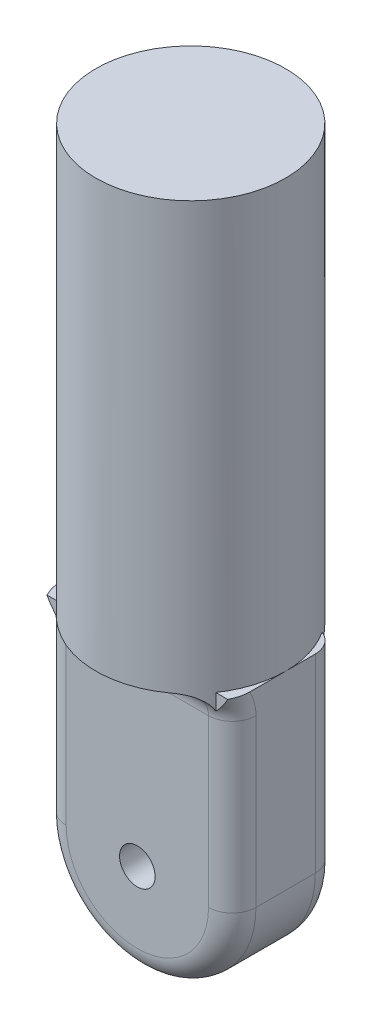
ISO-10303-21;
HEADER;
FILE_DESCRIPTION(('STEP AP214'),'2;1');
FILE_NAME('part.step','',(''),(''),'','','');
FILE_SCHEMA(('AUTOMOTIVE_DESIGN { 1 0 10303 214 1 1 1 1 }'));
ENDSEC;
DATA;
#1=APPLICATION_CONTEXT('core data for automotive mechanical design processes');
#2=APPLICATION_PROTOCOL_DEFINITION('international standard','automotive_design',2000,#1);
#3=PRODUCT_CONTEXT('',#1,'mechanical');
#4=PRODUCT('Part','Part','',(#3));
#5=PRODUCT_RELATED_PRODUCT_CATEGORY('part','',(#4));
#6=PRODUCT_DEFINITION_FORMATION('','',#4);
#7=PRODUCT_DEFINITION_CONTEXT('part definition',#1,'design');
#8=PRODUCT_DEFINITION('design','',#6,#7);
#9=PRODUCT_DEFINITION_SHAPE('','',#8);
#10=(LENGTH_UNIT() NAMED_UNIT(*) SI_UNIT(.MILLI.,.METRE.));
#11=(NAMED_UNIT(*) PLANE_ANGLE_UNIT() SI_UNIT($,.RADIAN.));
#12=(NAMED_UNIT(*) SI_UNIT($,.STERADIAN.) SOLID_ANGLE_UNIT());
#13=UNCERTAINTY_MEASURE_WITH_UNIT(LENGTH_MEASURE(1.E-05),#10,'distance_accuracy_value','');
#14=(GEOMETRIC_REPRESENTATION_CONTEXT(3) GLOBAL_UNCERTAINTY_ASSIGNED_CONTEXT((#13)) GLOBAL_UNIT_ASSIGNED_CONTEXT((#10,
#11,#12)) REPRESENTATION_CONTEXT('',''));
#15=CARTESIAN_POINT('',(0.,0.,0.));
#16=DIRECTION('',(0.,0.,1.));
#17=DIRECTION('',(1.,0.,0.));
#18=AXIS2_PLACEMENT_3D('',#15,#16,#17);
#19=CARTESIAN_POINT('',(0.,0.,14.2875));
#20=DIRECTION('',(0.,0.,1.));
#21=DIRECTION('',(1.,0.,0.));
#22=AXIS2_PLACEMENT_3D('',#19,#20,#21);
#23=PLANE('',#22);
#24=DIRECTION('',(0.,-1.,0.));
#25=VECTOR('',#24,1.);
#26=CARTESIAN_POINT('',(21.0006510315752,50.8,14.2875));
#27=LINE('',#26,#25);
#28=CARTESIAN_POINT('',(21.0006510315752,50.8,14.2875));
#29=VERTEX_POINT('',#28);
#30=CARTESIAN_POINT('',(21.0006510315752,46.4483935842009,14.2875));
#31=VERTEX_POINT('',#30);
#32=EDGE_CURVE('E209',#29,#31,#27,.T.);
#33=ORIENTED_EDGE('',*,*,#32,.T.);
#34=CARTESIAN_POINT('',(21.0006510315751,46.4483935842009,14.2875));
#35=CARTESIAN_POINT('',(21.366303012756,46.841466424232,14.2875));
#36=CARTESIAN_POINT('',(21.7243326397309,47.2430550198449,14.2875));
#37=CARTESIAN_POINT('',(22.4102900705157,48.0655256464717,14.2875));
#38=CARTESIAN_POINT('',(22.7384365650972,48.4862267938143,14.2875));
#39=CARTESIAN_POINT('',(23.2031749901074,49.1402212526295,14.2875));
#40=CARTESIAN_POINT('',(23.354182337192,49.3631991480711,14.2875));
#41=CARTESIAN_POINT('',(23.6446018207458,49.8165414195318,14.2875));
#42=CARTESIAN_POINT('',(23.7840163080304,50.0469042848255,14.2875));
#43=CARTESIAN_POINT('',(24.0505781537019,50.5171441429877,14.2875));
#44=CARTESIAN_POINT('',(24.1776169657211,50.7570831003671,14.2875));
#45=CARTESIAN_POINT('',(24.4163150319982,51.2447470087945,14.2875));
#46=CARTESIAN_POINT('',(24.5279600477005,51.4924789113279,14.2875));
#47=CARTESIAN_POINT('',(24.6308788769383,51.743909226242,14.2875));
#48=B_SPLINE_CURVE_WITH_KNOTS('',3,(#34,#35,#36,#37,#38,#39,#40,#41,#42,#43,#44,#45,#46,#47),
.UNSPECIFIED.,.F.,.F.,(4,2,2,2,2,2,4),(0.,1.61211219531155,3.21127521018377,4.01885255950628,
4.82626574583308,5.64022095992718,6.45492406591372),.UNSPECIFIED.);
#49=CARTESIAN_POINT('',(24.1964556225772,50.8,14.2875));
#50=VERTEX_POINT('',#49);
#51=EDGE_CURVE('E414',#31,#50,#48,.T.);
#52=ORIENTED_EDGE('',*,*,#51,.T.);
#53=DIRECTION('',(-1.,0.,0.));
#54=VECTOR('',#53,1.);
#55=CARTESIAN_POINT('',(-25.4,50.8,14.2875));
#56=LINE('',#55,#54);
#57=EDGE_CURVE('E187',#50,#29,#56,.T.);
#58=ORIENTED_EDGE('',*,*,#57,.T.);
#59=EDGE_LOOP('',(#33,#52,#58));
#60=FACE_BOUND('',#59,.T.);
#61=ADVANCED_FACE('F36',(#60),#23,.T.);
#62=CARTESIAN_POINT('',(0.,0.,14.2875));
#63=DIRECTION('',(0.,0.,1.));
#64=DIRECTION('',(1.,0.,0.));
#65=AXIS2_PLACEMENT_3D('',#62,#63,#64);
#66=CIRCLE('',#65,4.7625);
#67=CARTESIAN_POINT('',(4.7625,0.,14.2875));
#68=VERTEX_POINT('',#67);
#69=EDGE_CURVE('E477',#68,#68,#66,.T.);
#70=ORIENTED_EDGE('',*,*,#69,.F.);
#71=EDGE_LOOP('',(#70));
#72=FACE_BOUND('',#71,.T.);
#73=CARTESIAN_POINT('',(0.,0.,14.2875));
#74=DIRECTION('',(0.,0.,1.));
#75=DIRECTION('',(1.,0.,0.));
#76=AXIS2_PLACEMENT_3D('',#73,#74,#75);
#77=CIRCLE('',#76,19.05);
#78=CARTESIAN_POINT('',(-19.05,0.,14.2875));
#79=VERTEX_POINT('',#78);
#80=CARTESIAN_POINT('',(19.05,0.,14.2875));
#81=VERTEX_POINT('',#80);
#82=EDGE_CURVE('E409',#79,#81,#77,.T.);
#83=ORIENTED_EDGE('',*,*,#82,.T.);
#84=DIRECTION('',(0.,1.,0.));
#85=VECTOR('',#84,1.);
#86=CARTESIAN_POINT('',(19.05,50.8,14.2875));
#87=LINE('',#86,#85);
#88=CARTESIAN_POINT('',(19.05,44.45,14.2875));
#89=VERTEX_POINT('',#88);
#90=EDGE_CURVE('E411',#81,#89,#87,.T.);
#91=ORIENTED_EDGE('',*,*,#90,.T.);
#92=DIRECTION('',(-1.,0.,0.));
#93=VECTOR('',#92,1.);
#94=CARTESIAN_POINT('',(0.,44.45,14.2875));
#95=LINE('',#94,#93);
#96=CARTESIAN_POINT('',(-19.05,44.45,14.2875));
#97=VERTEX_POINT('',#96);
#98=EDGE_CURVE('E177',#89,#97,#95,.T.);
#99=ORIENTED_EDGE('',*,*,#98,.T.);
#100=DIRECTION('',(0.,-1.,0.));
#101=VECTOR('',#100,1.);
#102=CARTESIAN_POINT('',(-19.05,0.,14.2875));
#103=LINE('',#102,#101);
#104=EDGE_CURVE('E407',#97,#79,#103,.T.);
#105=ORIENTED_EDGE('',*,*,#104,.T.);
#106=EDGE_LOOP('',(#83,#91,#99,#105));
#107=FACE_BOUND('',#106,.T.);
#108=ADVANCED_FACE('F348',(#72,#107),#23,.T.);
#109=CARTESIAN_POINT('',(-25.4,50.8,14.2875));
#110=DIRECTION('',(0.,-1.,0.));
#111=DIRECTION('',(0.,0.,-1.));
#112=AXIS2_PLACEMENT_3D('',#109,#110,#111);
#113=PLANE('',#112);
#114=ORIENTED_EDGE('',*,*,#57,.F.);
#115=CARTESIAN_POINT('',(24.1964556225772,50.8,14.2875));
#116=CARTESIAN_POINT('',(24.3199061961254,50.8,14.0460022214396));
#117=CARTESIAN_POINT('',(24.4359016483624,50.8,13.8005579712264));
#118=CARTESIAN_POINT('',(24.6511155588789,50.8,13.3021019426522));
#119=CARTESIAN_POINT('',(24.7503143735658,50.8,13.0490817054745));
#120=CARTESIAN_POINT('',(24.9274933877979,50.8,12.5428736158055));
#121=CARTESIAN_POINT('',(25.0059484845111,50.8,12.2898532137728));
#122=CARTESIAN_POINT('',(25.1429953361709,50.8,11.7785502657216));
#123=CARTESIAN_POINT('',(25.2015948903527,50.8,11.5202698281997));
#124=CARTESIAN_POINT('',(25.2912364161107,50.8,11.0320996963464));
#125=CARTESIAN_POINT('',(25.324799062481,50.8,10.802673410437));
#126=CARTESIAN_POINT('',(25.3742303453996,50.8,10.3419394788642));
#127=CARTESIAN_POINT('',(25.3901022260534,50.8,10.1106321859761));
#128=CARTESIAN_POINT('',(25.4032726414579,50.8,9.6422676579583));
#129=CARTESIAN_POINT('',(25.4001473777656,50.8,9.40519763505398));
#130=CARTESIAN_POINT('',(25.3734212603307,50.8,8.93200232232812));
#131=CARTESIAN_POINT('',(25.3498009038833,50.8,8.69587814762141));
#132=CARTESIAN_POINT('',(25.3154802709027,50.8,8.4612228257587));
#133=B_SPLINE_CURVE_WITH_KNOTS('',3,(#115,#116,#117,#118,#119,#120,#121,#122,#123,#124,#125,
#126,#127,#128,#129,#130,#131,#132),.UNSPECIFIED.,.F.,.F.,(4,2,2,2,2,2,2,2,4),(0.,
0.813717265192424,1.62837969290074,2.42235254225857,3.21601315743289,3.91098147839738,
4.60582233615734,5.31622012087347,6.02729464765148),.UNSPECIFIED.);
#134=CARTESIAN_POINT('',(25.4,50.8,9.63897737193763));
#135=VERTEX_POINT('',#134);
#136=EDGE_CURVE('E378',#50,#135,#133,.T.);
#137=ORIENTED_EDGE('',*,*,#136,.T.);
#138=DIRECTION('',(0.,0.,-1.));
#139=VECTOR('',#138,1.);
#140=CARTESIAN_POINT('',(25.4,50.8,14.2875));
#141=LINE('',#140,#139);
#142=CARTESIAN_POINT('',(25.4,50.8,0.));
#143=VERTEX_POINT('',#142);
#144=EDGE_CURVE('E202',#135,#143,#141,.T.);
#145=ORIENTED_EDGE('',*,*,#144,.T.);
#146=CARTESIAN_POINT('',(0.,50.8,0.));
#147=DIRECTION('',(0.,1.,0.));
#148=DIRECTION('',(0.,0.,1.));
#149=AXIS2_PLACEMENT_3D('',#146,#147,#148);
#150=CIRCLE('',#149,25.4);
#151=EDGE_CURVE('E197',#29,#143,#150,.T.);
#152=ORIENTED_EDGE('',*,*,#151,.F.);
#153=EDGE_LOOP('',(#114,#137,#145,#152));
#154=FACE_BOUND('',#153,.T.);
#155=ADVANCED_FACE('F353',(#154),#113,.F.);
#156=CARTESIAN_POINT('',(25.4,50.8,-7.9375));
#157=VERTEX_POINT('',#156);
#158=EDGE_CURVE('E481',#143,#157,#141,.T.);
#159=ORIENTED_EDGE('',*,*,#158,.T.);
#160=CARTESIAN_POINT('',(19.05,50.8,-7.9375));
#161=DIRECTION('',(0.,-1.,0.));
#162=DIRECTION('',(0.,0.,-1.));
#163=AXIS2_PLACEMENT_3D('',#160,#161,#162);
#164=CIRCLE('',#163,6.35);
#165=CARTESIAN_POINT('',(21.2670184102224,50.8,-13.8879058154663));
#166=VERTEX_POINT('',#165);
#167=EDGE_CURVE('E234',#157,#166,#164,.F.);
#168=ORIENTED_EDGE('',*,*,#167,.T.);
#169=EDGE_CURVE('E198',#143,#166,#150,.T.);
#170=ORIENTED_EDGE('',*,*,#169,.F.);
#171=EDGE_LOOP('',(#159,#168,#170));
#172=FACE_BOUND('',#171,.T.);
#173=ADVANCED_FACE('F485',(#172),#113,.F.);
#174=CARTESIAN_POINT('',(-21.2670184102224,50.8,-13.8879058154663));
#175=VERTEX_POINT('',#174);
#176=CARTESIAN_POINT('',(-25.4,50.8,0.));
#177=VERTEX_POINT('',#176);
#178=EDGE_CURVE('E193',#175,#177,#150,.T.);
#179=ORIENTED_EDGE('',*,*,#178,.F.);
#180=CARTESIAN_POINT('',(-19.05,50.8,-7.9375));
#181=DIRECTION('',(0.,-1.,0.));
#182=DIRECTION('',(0.,0.,-1.));
#183=AXIS2_PLACEMENT_3D('',#180,#181,#182);
#184=CIRCLE('',#183,6.35);
#185=CARTESIAN_POINT('',(-25.4,50.8,-7.9375));
#186=VERTEX_POINT('',#185);
#187=EDGE_CURVE('E248',#175,#186,#184,.F.);
#188=ORIENTED_EDGE('',*,*,#187,.T.);
#189=DIRECTION('',(0.,0.,-1.));
#190=VECTOR('',#189,1.);
#191=CARTESIAN_POINT('',(-25.4,50.8,14.2875));
#192=LINE('',#191,#190);
#193=EDGE_CURVE('E474',#177,#186,#192,.T.);
#194=ORIENTED_EDGE('',*,*,#193,.F.);
#195=EDGE_LOOP('',(#179,#188,#194));
#196=FACE_BOUND('',#195,.T.);
#197=ADVANCED_FACE('F372',(#196),#113,.F.);
#198=CARTESIAN_POINT('',(0.,0.,14.2875));
#199=DIRECTION('',(0.,0.,-1.));
#200=DIRECTION('',(-1.,0.,0.));
#201=AXIS2_PLACEMENT_3D('',#198,#199,#200);
#202=CYLINDRICAL_SURFACE('',#201,25.4);
#203=DIRECTION('',(0.,0.,-1.));
#204=VECTOR('',#203,1.);
#205=CARTESIAN_POINT('',(-25.4,0.,14.2875));
#206=LINE('',#205,#204);
#207=CARTESIAN_POINT('',(-25.4,0.,7.9375));
#208=VERTEX_POINT('',#207);
#209=CARTESIAN_POINT('',(-25.4,0.,-7.9375));
#210=VERTEX_POINT('',#209);
#211=EDGE_CURVE('E472',#208,#210,#206,.T.);
#212=ORIENTED_EDGE('',*,*,#211,.T.);
#213=CARTESIAN_POINT('',(0.,0.,-7.9375));
#214=DIRECTION('',(0.,0.,1.));
#215=DIRECTION('',(1.,0.,0.));
#216=AXIS2_PLACEMENT_3D('',#213,#214,#215);
#217=CIRCLE('',#216,25.4);
#218=CARTESIAN_POINT('',(25.4,0.,-7.9375));
#219=VERTEX_POINT('',#218);
#220=EDGE_CURVE('E244',#210,#219,#217,.T.);
#221=ORIENTED_EDGE('',*,*,#220,.T.);
#222=DIRECTION('',(0.,0.,-1.));
#223=VECTOR('',#222,1.);
#224=CARTESIAN_POINT('',(25.4,0.,14.2875));
#225=LINE('',#224,#223);
#226=CARTESIAN_POINT('',(25.4,0.,7.9375));
#227=VERTEX_POINT('',#226);
#228=EDGE_CURVE('E195',#227,#219,#225,.T.);
#229=ORIENTED_EDGE('',*,*,#228,.F.);
#230=CARTESIAN_POINT('',(0.,0.,7.9375));
#231=DIRECTION('',(0.,0.,1.));
#232=DIRECTION('',(1.,0.,0.));
#233=AXIS2_PLACEMENT_3D('',#230,#231,#232);
#234=CIRCLE('',#233,25.4);
#235=EDGE_CURVE('E438',#227,#208,#234,.F.);
#236=ORIENTED_EDGE('',*,*,#235,.T.);
#237=EDGE_LOOP('',(#212,#221,#229,#236));
#238=FACE_BOUND('',#237,.T.);
#239=ADVANCED_FACE('F507',(#238),#202,.T.);
#240=CARTESIAN_POINT('',(25.4,0.,14.2875));
#241=DIRECTION('',(-1.,0.,0.));
#242=DIRECTION('',(0.,0.,1.));
#243=AXIS2_PLACEMENT_3D('',#240,#241,#242);
#244=PLANE('',#243);
#245=ORIENTED_EDGE('',*,*,#228,.T.);
#246=DIRECTION('',(0.,1.,0.));
#247=VECTOR('',#246,1.);
#248=CARTESIAN_POINT('',(25.4,0.,-7.9375));
#249=LINE('',#248,#247);
#250=EDGE_CURVE('E231',#219,#157,#249,.T.);
#251=ORIENTED_EDGE('',*,*,#250,.T.);
#252=ORIENTED_EDGE('',*,*,#158,.F.);
#253=ORIENTED_EDGE('',*,*,#144,.F.);
#254=CARTESIAN_POINT('',(25.4,44.45,20.6375));
#255=DIRECTION('',(-1.,0.,0.));
#256=DIRECTION('',(0.,0.,1.));
#257=AXIS2_PLACEMENT_3D('',#254,#255,#256);
#258=CIRCLE('',#257,12.7);
#259=CARTESIAN_POINT('',(25.4,44.45,7.9375));
#260=VERTEX_POINT('',#259);
#261=EDGE_CURVE('E443',#135,#260,#258,.T.);
#262=ORIENTED_EDGE('',*,*,#261,.T.);
#263=DIRECTION('',(0.,1.,0.));
#264=VECTOR('',#263,1.);
#265=CARTESIAN_POINT('',(25.4,0.,7.9375));
#266=LINE('',#265,#264);
#267=EDGE_CURVE('E446',#260,#227,#266,.F.);
#268=ORIENTED_EDGE('',*,*,#267,.T.);
#269=EDGE_LOOP('',(#245,#251,#252,#253,#262,#268));
#270=FACE_BOUND('',#269,.T.);
#271=ADVANCED_FACE('F370',(#270),#244,.F.);
#272=CARTESIAN_POINT('',(-25.4,50.8,9.63897737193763));
#273=VERTEX_POINT('',#272);
#274=EDGE_CURVE('E479',#273,#177,#192,.T.);
#275=ORIENTED_EDGE('',*,*,#274,.F.);
#276=CARTESIAN_POINT('',(-25.4,50.8,9.63897737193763));
#277=CARTESIAN_POINT('',(-25.4000387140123,50.8,9.91249944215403));
#278=CARTESIAN_POINT('',(-25.3867517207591,50.8,10.1858605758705));
#279=CARTESIAN_POINT('',(-25.3353581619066,50.8,10.729896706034));
#280=CARTESIAN_POINT('',(-25.2972846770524,50.8,11.0005747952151));
#281=CARTESIAN_POINT('',(-25.19926435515,50.8,11.5315319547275));
#282=CARTESIAN_POINT('',(-25.1398329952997,50.8,11.7919076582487));
#283=CARTESIAN_POINT('',(-25.0008412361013,50.8,12.3072518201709));
#284=CARTESIAN_POINT('',(-24.9212757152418,50.8,12.5622188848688));
#285=CARTESIAN_POINT('',(-24.7118529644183,50.8,13.1566518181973));
#286=CARTESIAN_POINT('',(-24.5742103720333,50.8,13.4933818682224));
#287=CARTESIAN_POINT('',(-24.2697841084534,50.8,14.1536417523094));
#288=CARTESIAN_POINT('',(-24.1029715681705,50.8,14.477158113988));
#289=CARTESIAN_POINT('',(-23.7391220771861,50.8,15.1205585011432));
#290=CARTESIAN_POINT('',(-23.5412778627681,50.8,15.4399812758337));
#291=CARTESIAN_POINT('',(-23.1248697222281,50.8,16.0638569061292));
#292=CARTESIAN_POINT('',(-22.9063622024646,50.8,16.3683472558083));
#293=CARTESIAN_POINT('',(-22.6796241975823,50.8,16.6661624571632));
#294=B_SPLINE_CURVE_WITH_KNOTS('',3,(#276,#277,#278,#279,#280,#281,#282,#283,#284,#285,#286,
#287,#288,#289,#290,#291,#292,#293),.UNSPECIFIED.,.F.,.F.,(4,2,2,2,2,2,2,2,4),(0.,
0.820008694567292,1.63892522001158,2.43927547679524,3.23982952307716,4.32948261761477,
5.42022029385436,6.54647260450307,7.66973466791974),.UNSPECIFIED.);
#295=CARTESIAN_POINT('',(-24.1964556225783,50.8,14.2875));
#296=VERTEX_POINT('',#295);
#297=EDGE_CURVE('E186',#273,#296,#294,.T.);
#298=ORIENTED_EDGE('',*,*,#297,.T.);
#299=CARTESIAN_POINT('',(-21.0006510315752,50.8,14.2875));
#300=VERTEX_POINT('',#299);
#301=EDGE_CURVE('E171',#300,#296,#56,.T.);
#302=ORIENTED_EDGE('',*,*,#301,.F.);
#303=EDGE_CURVE('E183',#177,#300,#150,.T.);
#304=ORIENTED_EDGE('',*,*,#303,.F.);
#305=EDGE_LOOP('',(#275,#298,#302,#304));
#306=FACE_BOUND('',#305,.T.);
#307=ADVANCED_FACE('F182',(#306),#113,.F.);
#308=CARTESIAN_POINT('',(-25.4,0.,14.2875));
#309=DIRECTION('',(1.,0.,0.));
#310=DIRECTION('',(0.,0.,-1.));
#311=AXIS2_PLACEMENT_3D('',#308,#309,#310);
#312=PLANE('',#311);
#313=ORIENTED_EDGE('',*,*,#193,.T.);
#314=DIRECTION('',(0.,-1.,0.));
#315=VECTOR('',#314,1.);
#316=CARTESIAN_POINT('',(-25.4,0.,-7.9375));
#317=LINE('',#316,#315);
#318=EDGE_CURVE('E246',#186,#210,#317,.T.);
#319=ORIENTED_EDGE('',*,*,#318,.T.);
#320=ORIENTED_EDGE('',*,*,#211,.F.);
#321=DIRECTION('',(0.,-1.,0.));
#322=VECTOR('',#321,1.);
#323=CARTESIAN_POINT('',(-25.4,50.8,7.9375));
#324=LINE('',#323,#322);
#325=CARTESIAN_POINT('',(-25.4,44.45,7.9375));
#326=VERTEX_POINT('',#325);
#327=EDGE_CURVE('E389',#208,#326,#324,.F.);
#328=ORIENTED_EDGE('',*,*,#327,.T.);
#329=CARTESIAN_POINT('',(-25.4,44.45,20.6375));
#330=DIRECTION('',(1.,0.,0.));
#331=DIRECTION('',(0.,0.,-1.));
#332=AXIS2_PLACEMENT_3D('',#329,#330,#331);
#333=CIRCLE('',#332,12.7);
#334=EDGE_CURVE('E442',#326,#273,#333,.T.);
#335=ORIENTED_EDGE('',*,*,#334,.T.);
#336=ORIENTED_EDGE('',*,*,#274,.T.);
#337=EDGE_LOOP('',(#313,#319,#320,#328,#335,#336));
#338=FACE_BOUND('',#337,.T.);
#339=ADVANCED_FACE('F359',(#338),#312,.F.);
#340=ORIENTED_EDGE('',*,*,#301,.T.);
#341=CARTESIAN_POINT('',(-24.1964556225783,50.8000000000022,14.2875));
#342=CARTESIAN_POINT('',(-23.9872920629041,50.3906657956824,14.2875));
#343=CARTESIAN_POINT('',(-23.7569911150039,49.9930078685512,14.2875));
#344=CARTESIAN_POINT('',(-23.2637590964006,49.2210697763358,14.2875));
#345=CARTESIAN_POINT('',(-23.0009932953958,48.8466846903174,14.2875));
#346=CARTESIAN_POINT('',(-22.4517870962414,48.1193650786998,14.2875));
#347=CARTESIAN_POINT('',(-22.1654858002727,47.7663232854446,14.2875));
#348=CARTESIAN_POINT('',(-21.573480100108,47.073844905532,14.2875));
#349=CARTESIAN_POINT('',(-21.2676885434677,46.7344823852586,14.2875));
#350=CARTESIAN_POINT('',(-20.9563459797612,46.4008323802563,14.2875));
#351=B_SPLINE_CURVE_WITH_KNOTS('',3,(#341,#342,#343,#344,#345,#346,#347,#348,#349,#350),
.UNSPECIFIED.,.F.,.F.,(4,2,2,2,4),(0.,1.37729963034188,2.74785631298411,4.11082628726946,
5.48038878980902),.UNSPECIFIED.);
#352=CARTESIAN_POINT('',(-21.0006510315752,46.448393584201,14.2875));
#353=VERTEX_POINT('',#352);
#354=EDGE_CURVE('E173',#296,#353,#351,.T.);
#355=ORIENTED_EDGE('',*,*,#354,.T.);
#356=DIRECTION('',(0.,-1.,0.));
#357=VECTOR('',#356,1.);
#358=CARTESIAN_POINT('',(-21.0006510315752,44.45,14.2875));
#359=LINE('',#358,#357);
#360=EDGE_CURVE('E168',#353,#300,#359,.F.);
#361=ORIENTED_EDGE('',*,*,#360,.T.);
#362=EDGE_LOOP('',(#340,#355,#361));
#363=FACE_BOUND('',#362,.T.);
#364=ADVANCED_FACE('F170',(#363),#23,.T.);
#365=CARTESIAN_POINT('',(0.,0.,-14.2875));
#366=DIRECTION('',(0.,0.,1.));
#367=DIRECTION('',(1.,0.,0.));
#368=AXIS2_PLACEMENT_3D('',#365,#366,#367);
#369=PLANE('',#368);
#370=CARTESIAN_POINT('',(0.,0.,-14.2875));
#371=DIRECTION('',(0.,0.,1.));
#372=DIRECTION('',(1.,0.,0.));
#373=AXIS2_PLACEMENT_3D('',#370,#371,#372);
#374=CIRCLE('',#373,4.7625);
#375=CARTESIAN_POINT('',(4.7625,0.,-14.2875));
#376=VERTEX_POINT('',#375);
#377=EDGE_CURVE('E188',#376,#376,#374,.T.);
#378=ORIENTED_EDGE('',*,*,#377,.T.);
#379=EDGE_LOOP('',(#378));
#380=FACE_BOUND('',#379,.T.);
#381=DIRECTION('',(0.,-1.,0.));
#382=VECTOR('',#381,1.);
#383=CARTESIAN_POINT('',(-19.05,0.,-14.2875));
#384=LINE('',#383,#382);
#385=CARTESIAN_POINT('',(-19.05,0.,-14.2875));
#386=VERTEX_POINT('',#385);
#387=CARTESIAN_POINT('',(-19.05,44.45,-14.2875));
#388=VERTEX_POINT('',#387);
#389=EDGE_CURVE('E237',#386,#388,#384,.F.);
#390=ORIENTED_EDGE('',*,*,#389,.T.);
#391=DIRECTION('',(-1.,0.,0.));
#392=VECTOR('',#391,1.);
#393=CARTESIAN_POINT('',(19.05,44.45,-14.2875));
#394=LINE('',#393,#392);
#395=CARTESIAN_POINT('',(19.05,44.45,-14.2875));
#396=VERTEX_POINT('',#395);
#397=EDGE_CURVE('E267',#388,#396,#394,.F.);
#398=ORIENTED_EDGE('',*,*,#397,.T.);
#399=DIRECTION('',(0.,1.,0.));
#400=VECTOR('',#399,1.);
#401=CARTESIAN_POINT('',(19.05,0.,-14.2875));
#402=LINE('',#401,#400);
#403=CARTESIAN_POINT('',(19.05,0.,-14.2875));
#404=VERTEX_POINT('',#403);
#405=EDGE_CURVE('E242',#396,#404,#402,.F.);
#406=ORIENTED_EDGE('',*,*,#405,.T.);
#407=CARTESIAN_POINT('',(0.,0.,-14.2875));
#408=DIRECTION('',(0.,0.,1.));
#409=DIRECTION('',(1.,0.,0.));
#410=AXIS2_PLACEMENT_3D('',#407,#408,#409);
#411=CIRCLE('',#410,19.05);
#412=EDGE_CURVE('E240',#404,#386,#411,.F.);
#413=ORIENTED_EDGE('',*,*,#412,.T.);
#414=EDGE_LOOP('',(#390,#398,#406,#413));
#415=FACE_BOUND('',#414,.T.);
#416=ADVANCED_FACE('F358',(#380,#415),#369,.F.);
#417=CARTESIAN_POINT('',(0.,0.,-14.2875));
#418=DIRECTION('',(0.,0.,1.));
#419=DIRECTION('',(1.,0.,0.));
#420=AXIS2_PLACEMENT_3D('',#417,#418,#419);
#421=CYLINDRICAL_SURFACE('',#420,4.7625);
#422=ORIENTED_EDGE('',*,*,#377,.F.);
#423=EDGE_LOOP('',(#422));
#424=FACE_BOUND('',#423,.T.);
#425=ORIENTED_EDGE('',*,*,#69,.T.);
#426=EDGE_LOOP('',(#425));
#427=FACE_BOUND('',#426,.T.);
#428=ADVANCED_FACE('F292',(#424,#427),#421,.F.);
#429=CARTESIAN_POINT('',(0.,50.8,0.));
#430=DIRECTION('',(0.,1.,0.));
#431=DIRECTION('',(0.,0.,1.));
#432=AXIS2_PLACEMENT_3D('',#429,#430,#431);
#433=PLANE('',#432);
#434=CARTESIAN_POINT('',(14.8072142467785,50.8,-20.6375));
#435=VERTEX_POINT('',#434);
#436=CARTESIAN_POINT('',(-14.8072142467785,50.8,-20.6375));
#437=VERTEX_POINT('',#436);
#438=EDGE_CURVE('E200',#435,#437,#150,.T.);
#439=ORIENTED_EDGE('',*,*,#438,.F.);
#440=DIRECTION('',(-1.,0.,0.));
#441=VECTOR('',#440,1.);
#442=CARTESIAN_POINT('',(-19.05,50.8,-20.6375));
#443=LINE('',#442,#441);
#444=EDGE_CURVE('E265',#435,#437,#443,.T.);
#445=ORIENTED_EDGE('',*,*,#444,.T.);
#446=EDGE_LOOP('',(#439,#445));
#447=FACE_BOUND('',#446,.T.);
#448=ADVANCED_FACE('F289',(#447),#433,.F.);
#449=CARTESIAN_POINT('',(0.,165.1,0.));
#450=DIRECTION('',(0.,-1.,0.));
#451=DIRECTION('',(0.,0.,-1.));
#452=AXIS2_PLACEMENT_3D('',#449,#450,#451);
#453=CYLINDRICAL_SURFACE('',#452,25.4);
#454=ORIENTED_EDGE('',*,*,#438,.T.);
#455=CARTESIAN_POINT('',(-14.8072142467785,50.8,-20.6375));
#456=CARTESIAN_POINT('',(-14.9527766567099,50.7999949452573,-20.5330613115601));
#457=CARTESIAN_POINT('',(-15.0972239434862,50.7974232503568,-20.4270869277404));
#458=CARTESIAN_POINT('',(-15.3837523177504,50.7866551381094,-20.2121808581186));
#459=CARTESIAN_POINT('',(-15.5258326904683,50.7784570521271,-20.1032483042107));
#460=CARTESIAN_POINT('',(-15.9490561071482,50.7446184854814,-19.7716008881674));
#461=CARTESIAN_POINT('',(-16.226284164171,50.7097275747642,-19.5446801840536));
#462=CARTESIAN_POINT('',(-16.7581857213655,50.6128561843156,-19.0903415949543));
#463=CARTESIAN_POINT('',(-17.0133122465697,50.551900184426,-18.8632379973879));
#464=CARTESIAN_POINT('',(-17.5090299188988,50.3991552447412,-18.4040115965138));
#465=CARTESIAN_POINT('',(-17.7496418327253,50.3074116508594,-18.1718966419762));
#466=CARTESIAN_POINT('',(-18.1189696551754,50.1336547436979,-17.8017109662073));
#467=CARTESIAN_POINT('',(-18.2533049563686,50.0629287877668,-17.6638874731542));
#468=CARTESIAN_POINT('',(-18.5152374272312,49.9085200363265,-17.3891336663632));
#469=CARTESIAN_POINT('',(-18.6428366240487,49.8248411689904,-17.2522030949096));
#470=CARTESIAN_POINT('',(-18.8932327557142,49.6419016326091,-16.9776597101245));
#471=CARTESIAN_POINT('',(-19.015868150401,49.5423454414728,-16.8400951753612));
#472=CARTESIAN_POINT('',(-19.252655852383,49.3283997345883,-16.5688867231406));
#473=CARTESIAN_POINT('',(-19.3667974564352,49.2139919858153,-16.4352478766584));
#474=CARTESIAN_POINT('',(-19.4761871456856,49.09198091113,-16.304543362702));
#475=B_SPLINE_CURVE_WITH_KNOTS('',3,(#455,#456,#457,#458,#459,#460,#461,#462,#463,#464,#465,
#466,#467,#468,#469,#470,#471,#472,#473,#474),.UNSPECIFIED.,.F.,.F.,(4,2,2,2,2,2,2,2,2,4),(0.,
0.53740109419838,1.07496163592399,2.15338710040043,3.19284220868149,4.23077301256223,
4.84546227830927,5.4599654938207,6.08763921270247,6.71609093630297),.UNSPECIFIED.);
#476=CARTESIAN_POINT('',(-19.05,49.5096532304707,-16.8005208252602));
#477=VERTEX_POINT('',#476);
#478=EDGE_CURVE('E11',#437,#477,#475,.T.);
#479=ORIENTED_EDGE('',*,*,#478,.T.);
#480=CARTESIAN_POINT('',(-19.05,49.5096532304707,-16.8005208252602));
#481=CARTESIAN_POINT('',(-19.1269602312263,49.4434731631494,-16.7132574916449));
#482=CARTESIAN_POINT('',(-19.2024029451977,49.3748914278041,-16.626502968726));
#483=CARTESIAN_POINT('',(-19.3501961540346,49.2329425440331,-16.4542633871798));
#484=CARTESIAN_POINT('',(-19.4225463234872,49.1595748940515,-16.3687784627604));
#485=CARTESIAN_POINT('',(-19.6352227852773,48.931940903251,-16.1141851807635));
#486=CARTESIAN_POINT('',(-19.770767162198,48.7704938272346,-15.9474027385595));
#487=CARTESIAN_POINT('',(-20.0306524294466,48.4256174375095,-15.6197798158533));
#488=CARTESIAN_POINT('',(-20.1547360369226,48.2418331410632,-15.4591090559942));
#489=CARTESIAN_POINT('',(-20.3875056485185,47.8549254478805,-15.1508017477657));
#490=CARTESIAN_POINT('',(-20.4962137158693,47.6518304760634,-15.0031466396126));
#491=CARTESIAN_POINT('',(-20.6481092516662,47.3288098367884,-14.7926824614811));
#492=CARTESIAN_POINT('',(-20.6975917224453,47.2160676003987,-14.7233259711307));
#493=CARTESIAN_POINT('',(-20.791577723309,46.9853237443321,-14.590302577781));
#494=CARTESIAN_POINT('',(-20.8360814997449,46.8673223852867,-14.5266353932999));
#495=CARTESIAN_POINT('',(-20.9610370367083,46.5064745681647,-14.3462943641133));
#496=CARTESIAN_POINT('',(-21.0335417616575,46.2555123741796,-14.239428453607));
#497=CARTESIAN_POINT('',(-21.1167827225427,45.8893847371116,-14.1153599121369));
#498=CARTESIAN_POINT('',(-21.1386675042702,45.7818351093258,-14.0825416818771));
#499=CARTESIAN_POINT('',(-21.1776172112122,45.5640126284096,-14.0238997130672));
#500=CARTESIAN_POINT('',(-21.1946848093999,45.4537413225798,-13.9980720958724));
#501=CARTESIAN_POINT('',(-21.2236288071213,45.2310096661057,-13.954149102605));
#502=CARTESIAN_POINT('',(-21.2355061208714,45.1185497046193,-13.9360523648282));
#503=CARTESIAN_POINT('',(-21.2537642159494,44.8921940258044,-13.9081913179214));
#504=CARTESIAN_POINT('',(-21.2601472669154,44.77829892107,-13.8984235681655));
#505=CARTESIAN_POINT('',(-21.2672425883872,44.5498418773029,-13.8875641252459));
#506=CARTESIAN_POINT('',(-21.2679512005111,44.4352795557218,-13.886478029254));
#507=CARTESIAN_POINT('',(-21.2636675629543,44.206480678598,-13.8930361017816));
#508=CARTESIAN_POINT('',(-21.258673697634,44.0922442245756,-13.9006827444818));
#509=CARTESIAN_POINT('',(-21.2430627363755,43.8641579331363,-13.9245288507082));
#510=CARTESIAN_POINT('',(-21.2324015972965,43.7503182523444,-13.9407952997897));
#511=CARTESIAN_POINT('',(-21.2057441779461,43.524755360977,-13.9813067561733));
#512=CARTESIAN_POINT('',(-21.1897506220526,43.4130311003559,-14.0055476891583));
#513=CARTESIAN_POINT('',(-21.171242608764,43.3027126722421,-14.0334773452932));
#514=B_SPLINE_CURVE_WITH_KNOTS('',3,(#480,#481,#482,#483,#484,#485,#486,#487,#488,#489,#490,
#491,#492,#493,#494,#495,#496,#497,#498,#499,#500,#501,#502,#503,#504,#505,#506,#507,#508,#509,
#510,#511,#512,#513),.UNSPECIFIED.,.F.,.F.,(4,2,2,2,2,2,2,2,2,2,2,2,2,2,2,2,4),(0.,
0.401503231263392,0.803048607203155,1.60826339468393,2.42855445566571,3.24765622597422,
3.67131757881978,4.09495795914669,4.93733056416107,5.28073535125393,5.62394921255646,
5.96710259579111,6.31011415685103,6.65334684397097,6.99667680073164,7.34271480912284,
7.68857629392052),.UNSPECIFIED.);
#515=CARTESIAN_POINT('',(-21.2670184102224,44.4499999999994,-13.8879058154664));
#516=VERTEX_POINT('',#515);
#517=EDGE_CURVE('E276',#477,#516,#514,.T.);
#518=ORIENTED_EDGE('',*,*,#517,.T.);
#519=DIRECTION('',(0.,1.,0.));
#520=VECTOR('',#519,1.);
#521=CARTESIAN_POINT('',(-21.2670184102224,165.1,-13.8879058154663));
#522=LINE('',#521,#520);
#523=EDGE_CURVE('E54',#175,#516,#522,.F.);
#524=ORIENTED_EDGE('',*,*,#523,.F.);
#525=ORIENTED_EDGE('',*,*,#178,.T.);
#526=ORIENTED_EDGE('',*,*,#303,.T.);
#527=ORIENTED_EDGE('',*,*,#360,.F.);
#528=CARTESIAN_POINT('',(-21.0006510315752,46.448393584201,14.2875));
#529=CARTESIAN_POINT('',(-20.9532387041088,46.6189641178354,14.357198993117));
#530=CARTESIAN_POINT('',(-20.9000407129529,46.7845099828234,14.4346405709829));
#531=CARTESIAN_POINT('',(-20.7832699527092,47.1046337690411,14.6022603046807));
#532=CARTESIAN_POINT('',(-20.7197229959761,47.2592376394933,14.6924066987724));
#533=CARTESIAN_POINT('',(-20.5847807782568,47.5539658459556,14.8808578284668));
#534=CARTESIAN_POINT('',(-20.5136001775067,47.6943417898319,14.9789266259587));
#535=CARTESIAN_POINT('',(-20.3631254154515,47.9647629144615,15.182858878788));
#536=CARTESIAN_POINT('',(-20.2838271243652,48.0948027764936,15.2887262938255));
#537=CARTESIAN_POINT('',(-20.0819593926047,48.3992147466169,15.5535618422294));
#538=CARTESIAN_POINT('',(-19.9555458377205,48.5683352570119,15.7156360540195));
#539=CARTESIAN_POINT('',(-19.6898255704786,48.8883434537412,16.0473066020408));
#540=CARTESIAN_POINT('',(-19.5505026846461,49.0392077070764,16.2169122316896));
#541=CARTESIAN_POINT('',(-19.2557160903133,49.3304020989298,16.5659712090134));
#542=CARTESIAN_POINT('',(-19.0998529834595,49.470161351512,16.7455596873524));
#543=CARTESIAN_POINT('',(-18.8588735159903,49.6695857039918,17.0152110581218));
#544=CARTESIAN_POINT('',(-18.777491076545,49.734258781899,17.1049898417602));
#545=CARTESIAN_POINT('',(-18.6124688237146,49.8607621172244,17.2844111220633));
#546=CARTESIAN_POINT('',(-18.5288297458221,49.9225932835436,17.3740536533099));
#547=CARTESIAN_POINT('',(-18.4441410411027,49.983257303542,17.4634951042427));
#548=B_SPLINE_CURVE_WITH_KNOTS('',3,(#528,#529,#530,#531,#532,#533,#534,#535,#536,#537,#538,
#539,#540,#541,#542,#543,#544,#545,#546,#547),.UNSPECIFIED.,.F.,.F.,(4,2,2,2,2,2,2,2,2,4),(0.,
0.57015481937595,1.13890874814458,1.69455320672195,2.25048176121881,3.04766712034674,
3.84586509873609,4.67265393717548,5.0846778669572,5.49656909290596),.UNSPECIFIED.);
#549=CARTESIAN_POINT('',(-19.05,49.5096532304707,16.8005208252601));
#550=VERTEX_POINT('',#549);
#551=EDGE_CURVE('E313',#353,#550,#548,.T.);
#552=ORIENTED_EDGE('',*,*,#551,.T.);
#553=CARTESIAN_POINT('',(-9.75736636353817,38.7573565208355,23.4510938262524));
#554=CARTESIAN_POINT('',(-9.99911208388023,38.7076441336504,23.3505062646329));
#555=CARTESIAN_POINT('',(-10.2395396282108,38.6593498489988,23.2460886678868));
#556=CARTESIAN_POINT('',(-10.7177091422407,38.5665882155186,23.0295390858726));
#557=CARTESIAN_POINT('',(-10.9554504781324,38.5221217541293,22.9174053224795));
#558=CARTESIAN_POINT('',(-11.6661637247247,38.3956717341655,22.5685571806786));
#559=CARTESIAN_POINT('',(-12.1348231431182,38.3210227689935,22.3201442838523));
#560=CARTESIAN_POINT('',(-13.0642953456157,38.1993225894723,21.7893158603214));
#561=CARTESIAN_POINT('',(-13.5249336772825,38.1526327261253,21.5065096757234));
#562=CARTESIAN_POINT('',(-14.4282966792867,38.0988750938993,20.9111389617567));
#563=CARTESIAN_POINT('',(-14.8710532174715,38.0917334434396,20.5986310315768));
#564=CARTESIAN_POINT('',(-15.5140985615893,38.1196614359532,20.1132596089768));
#565=CARTESIAN_POINT('',(-15.722923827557,38.1350673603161,19.950427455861));
#566=CARTESIAN_POINT('',(-16.1345163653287,38.1799737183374,19.6190494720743));
#567=CARTESIAN_POINT('',(-16.3372834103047,38.2094746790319,19.4505034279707));
#568=CARTESIAN_POINT('',(-16.7354407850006,38.2842345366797,19.1089949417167));
#569=CARTESIAN_POINT('',(-16.9308444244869,38.3294633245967,18.9360415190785));
#570=CARTESIAN_POINT('',(-17.3136190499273,38.4374985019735,18.5867078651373));
#571=CARTESIAN_POINT('',(-17.5009902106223,38.5003045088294,18.410327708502));
#572=CARTESIAN_POINT('',(-17.8692384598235,38.6464197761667,18.0531737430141));
#573=CARTESIAN_POINT('',(-18.0499738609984,38.7300256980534,17.872373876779));
#574=CARTESIAN_POINT('',(-18.4004336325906,38.9190701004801,17.5113482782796));
#575=CARTESIAN_POINT('',(-18.5701563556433,39.0245118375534,17.3311226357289));
#576=CARTESIAN_POINT('',(-18.8965121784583,39.258500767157,16.974689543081));
#577=CARTESIAN_POINT('',(-19.0531745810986,39.3869940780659,16.7984737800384));
#578=CARTESIAN_POINT('',(-19.3519922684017,39.6682869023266,16.4533405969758));
#579=CARTESIAN_POINT('',(-19.4941571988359,39.8210700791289,16.2844183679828));
#580=CARTESIAN_POINT('',(-19.7136256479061,40.0913984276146,16.0172150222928));
#581=CARTESIAN_POINT('',(-19.795776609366,40.201673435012,15.9155014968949));
#582=CARTESIAN_POINT('',(-19.9529881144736,40.4320892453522,15.7179571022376));
#583=CARTESIAN_POINT('',(-20.0280504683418,40.5522275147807,15.6221247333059));
#584=CARTESIAN_POINT('',(-20.1706572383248,40.8020918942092,15.4375581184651));
#585=CARTESIAN_POINT('',(-20.2382004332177,40.9318195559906,15.3488250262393));
#586=CARTESIAN_POINT('',(-20.3653424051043,41.2003305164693,15.1797240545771));
#587=CARTESIAN_POINT('',(-20.4249409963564,41.3391140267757,15.0993563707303));
#588=CARTESIAN_POINT('',(-20.5361803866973,41.6259357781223,14.9477156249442));
#589=CARTESIAN_POINT('',(-20.5877663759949,41.7740287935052,14.8765057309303));
#590=CARTESIAN_POINT('',(-20.6821717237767,42.0776523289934,14.7449764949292));
#591=CARTESIAN_POINT('',(-20.7249919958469,42.2331820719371,14.6846560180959));
#592=CARTESIAN_POINT('',(-20.8015409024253,42.5502683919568,14.5760183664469));
#593=CARTESIAN_POINT('',(-20.8352836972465,42.7118151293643,14.527682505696));
#594=CARTESIAN_POINT('',(-20.893542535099,43.0397377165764,14.4437700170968));
#595=CARTESIAN_POINT('',(-20.9180627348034,43.2061113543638,14.4081876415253));
#596=CARTESIAN_POINT('',(-20.9587745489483,43.5509636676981,14.3489071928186));
#597=CARTESIAN_POINT('',(-20.9744703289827,43.7296236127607,14.3259182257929));
#598=CARTESIAN_POINT('',(-20.9954081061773,44.088862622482,14.295215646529));
#599=CARTESIAN_POINT('',(-21.0006505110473,44.2694416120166,14.2875014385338));
#600=CARTESIAN_POINT('',(-21.0006514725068,44.6029484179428,14.2874987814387));
#601=CARTESIAN_POINT('',(-20.9968905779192,44.7558820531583,14.2930318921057));
#602=CARTESIAN_POINT('',(-20.9818635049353,45.0606371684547,14.3150824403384));
#603=CARTESIAN_POINT('',(-20.9705950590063,45.2124582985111,14.3316031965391));
#604=CARTESIAN_POINT('',(-20.9405872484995,45.5139565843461,14.3754133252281));
#605=CARTESIAN_POINT('',(-20.9218397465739,45.663631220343,14.4027144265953));
#606=CARTESIAN_POINT('',(-20.8769634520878,45.9595879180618,14.4676865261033));
#607=CARTESIAN_POINT('',(-20.8508343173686,46.1058698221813,14.5053580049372));
#608=CARTESIAN_POINT('',(-20.7914059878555,46.393623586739,14.5904118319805));
#609=CARTESIAN_POINT('',(-20.7581268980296,46.5351076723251,14.6377669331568));
#610=CARTESIAN_POINT('',(-20.684520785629,46.8127922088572,14.7415957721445));
#611=CARTESIAN_POINT('',(-20.6441936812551,46.9489925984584,14.7980696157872));
#612=CARTESIAN_POINT('',(-20.5567119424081,47.2152709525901,14.9193558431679));
#613=CARTESIAN_POINT('',(-20.5095601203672,47.3453514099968,14.984164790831));
#614=CARTESIAN_POINT('',(-20.408637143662,47.5988417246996,15.1213352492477));
#615=CARTESIAN_POINT('',(-20.3548636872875,47.7222492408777,15.1936993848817));
#616=CARTESIAN_POINT('',(-20.238811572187,47.9663907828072,15.3479695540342));
#617=CARTESIAN_POINT('',(-20.1762872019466,48.0868445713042,15.4301338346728));
#618=CARTESIAN_POINT('',(-20.0447171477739,48.3195828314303,15.6006703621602));
#619=CARTESIAN_POINT('',(-19.9756689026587,48.4318640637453,15.6890450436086));
#620=CARTESIAN_POINT('',(-19.8314149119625,48.6479609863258,15.8709942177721));
#621=CARTESIAN_POINT('',(-19.7562082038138,48.7517753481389,15.9645695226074));
#622=CARTESIAN_POINT('',(-19.6000121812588,48.9508110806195,16.1559522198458));
#623=CARTESIAN_POINT('',(-19.5190217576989,49.0460307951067,16.2537604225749));
#624=CARTESIAN_POINT('',(-19.3176738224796,49.2647621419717,16.4930535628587));
#625=CARTESIAN_POINT('',(-19.1946730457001,49.3840839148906,16.636162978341));
#626=CARTESIAN_POINT('',(-18.9390356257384,49.6060933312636,16.9266179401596));
#627=CARTESIAN_POINT('',(-18.8063959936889,49.7087757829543,17.0739647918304));
#628=CARTESIAN_POINT('',(-18.5324183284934,49.8982355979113,17.3709614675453));
#629=CARTESIAN_POINT('',(-18.3910745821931,49.9850023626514,17.5206127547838));
#630=CARTESIAN_POINT('',(-18.1006904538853,50.1434637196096,17.8204552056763));
#631=CARTESIAN_POINT('',(-17.9516476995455,50.2151536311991,17.9706465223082));
#632=CARTESIAN_POINT('',(-17.5744677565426,50.3751163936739,18.3411320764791));
#633=CARTESIAN_POINT('',(-17.3423169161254,50.4551501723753,18.5609214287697));
#634=CARTESIAN_POINT('',(-16.8655832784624,50.5881473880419,18.9951641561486));
#635=CARTESIAN_POINT('',(-16.6209938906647,50.6410963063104,19.2096146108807));
#636=CARTESIAN_POINT('',(-16.1200066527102,50.7235889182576,19.6319467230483));
#637=CARTESIAN_POINT('',(-15.8635488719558,50.7529959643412,19.8397834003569));
#638=CARTESIAN_POINT('',(-15.3417320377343,50.7912033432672,20.246005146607));
#639=CARTESIAN_POINT('',(-15.0763698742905,50.7999963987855,20.4443868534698));
#640=CARTESIAN_POINT('',(-14.4015359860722,50.8000054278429,20.9285650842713));
#641=CARTESIAN_POINT('',(-13.9872400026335,50.7800435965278,21.2076614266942));
#642=CARTESIAN_POINT('',(-13.1445592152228,50.7093191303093,21.7400448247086));
#643=CARTESIAN_POINT('',(-12.7161586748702,50.6585209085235,21.9933016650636));
#644=CARTESIAN_POINT('',(-11.856271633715,50.5351957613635,22.4683195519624));
#645=CARTESIAN_POINT('',(-11.4250046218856,50.4631075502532,22.6905945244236));
#646=CARTESIAN_POINT('',(-10.7715327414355,50.3435380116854,23.0041800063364));
#647=CARTESIAN_POINT('',(-10.5528873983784,50.3018337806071,23.1052914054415));
#648=CARTESIAN_POINT('',(-10.113343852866,50.215373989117,23.3010323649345));
#649=CARTESIAN_POINT('',(-9.89244594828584,50.1706188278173,23.395662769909));
#650=CARTESIAN_POINT('',(-9.67044552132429,50.1247200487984,23.4870705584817));
#651=B_SPLINE_CURVE_WITH_KNOTS('',3,(#553,#554,#555,#556,#557,#558,#559,#560,#561,#562,#563,
#564,#565,#566,#567,#568,#569,#570,#571,#572,#573,#574,#575,#576,#577,#578,#579,#580,#581,#582,
#583,#584,#585,#586,#587,#588,#589,#590,#591,#592,#593,#594,#595,#596,#597,#598,#599,#600,#601,
#602,#603,#604,#605,#606,#607,#608,#609,#610,#611,#612,#613,#614,#615,#616,#617,#618,#619,#620,
#621,#622,#623,#624,#625,#626,#627,#628,#629,#630,#631,#632,#633,#634,#635,#636,#637,#638,#639,
#640,#641,#642,#643,#644,#645,#646,#647,#648,#649,#650),.UNSPECIFIED.,.F.,.F.,(4,2,2,2,2,2,2,2,
2,2,2,2,2,2,2,2,2,2,2,2,2,2,2,2,2,2,2,2,2,2,2,2,2,2,2,2,2,2,2,2,2,2,2,2,2,2,2,2,4),(0.,
0.799472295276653,1.59912944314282,3.20439678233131,4.82998675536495,6.45253887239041,
7.2478912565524,8.04327338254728,8.83714115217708,9.63099164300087,10.4368882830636,
11.2429051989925,12.0470620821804,12.8506803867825,13.3633355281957,13.8758593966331,
14.388466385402,14.9010853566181,15.4170695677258,15.9329999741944,16.448120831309,
16.9630092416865,17.5045034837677,18.0459766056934,18.5046507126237,18.9634634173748,
19.4227766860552,19.8821112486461,20.3401707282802,20.7982355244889,21.2561120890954,
21.714148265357,22.1896066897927,22.6652525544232,23.1409729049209,23.6167847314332,
24.2855891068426,24.9546017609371,25.6240583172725,26.2937224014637,27.2807079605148,
28.2682220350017,29.2614273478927,30.2549832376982,31.7524961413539,33.2517405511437,
34.7220224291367,35.4553557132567,36.1885932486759),.UNSPECIFIED.);
#652=CARTESIAN_POINT('',(-14.8072142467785,50.8,20.6375));
#653=VERTEX_POINT('',#652);
#654=EDGE_CURVE('E297',#550,#653,#651,.T.);
#655=ORIENTED_EDGE('',*,*,#654,.T.);
#656=CARTESIAN_POINT('',(14.8072142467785,50.8,20.6375));
#657=VERTEX_POINT('',#656);
#658=EDGE_CURVE('E199',#653,#657,#150,.T.);
#659=ORIENTED_EDGE('',*,*,#658,.T.);
#660=CARTESIAN_POINT('',(9.67044552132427,50.1247200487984,23.4870705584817));
#661=CARTESIAN_POINT('',(9.89200202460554,50.170527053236,23.3958455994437));
#662=CARTESIAN_POINT('',(10.1124605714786,50.2151950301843,23.3014107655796));
#663=CARTESIAN_POINT('',(10.5511404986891,50.3014953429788,23.1060842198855));
#664=CARTESIAN_POINT('',(10.7693615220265,50.3431272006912,23.0051914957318));
#665=CARTESIAN_POINT('',(11.4215450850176,50.4625014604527,22.69231510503));
#666=CARTESIAN_POINT('',(11.8519628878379,50.5344950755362,22.4705712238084));
#667=CARTESIAN_POINT('',(12.7119178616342,50.6579964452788,21.9957744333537));
#668=CARTESIAN_POINT('',(13.1411910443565,50.7089767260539,21.7421027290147));
#669=CARTESIAN_POINT('',(13.985583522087,50.7799638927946,21.2087773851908));
#670=CARTESIAN_POINT('',(14.4007179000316,50.8000048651,20.9291526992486));
#671=CARTESIAN_POINT('',(15.0949073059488,50.7999965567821,20.4310861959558));
#672=CARTESIAN_POINT('',(15.3782736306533,50.7899522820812,20.2186476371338));
#673=CARTESIAN_POINT('',(15.9348909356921,50.7460431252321,19.7829238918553));
#674=CARTESIAN_POINT('',(16.2081394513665,50.7121724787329,19.5596360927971));
#675=CARTESIAN_POINT('',(16.740183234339,50.6169202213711,19.106214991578));
#676=CARTESIAN_POINT('',(16.9990776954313,50.5557638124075,18.8761518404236));
#677=CARTESIAN_POINT('',(17.502141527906,50.4017776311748,18.4106537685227));
#678=CARTESIAN_POINT('',(17.7463223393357,50.3089728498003,18.1752232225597));
#679=CARTESIAN_POINT('',(18.1204803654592,50.1329443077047,17.8001971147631));
#680=CARTESIAN_POINT('',(18.2562592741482,50.0613734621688,17.6608568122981));
#681=CARTESIAN_POINT('',(18.5209249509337,49.9049749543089,17.3830973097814));
#682=CARTESIAN_POINT('',(18.6498137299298,49.8201511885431,17.2446778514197));
#683=CARTESIAN_POINT('',(18.8999625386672,49.6365499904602,16.9701479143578));
#684=CARTESIAN_POINT('',(19.0212216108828,49.5377708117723,16.8340377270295));
#685=CARTESIAN_POINT('',(19.2552694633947,49.3257662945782,16.5658160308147));
#686=CARTESIAN_POINT('',(19.3680592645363,49.2125427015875,16.4337040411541));
#687=CARTESIAN_POINT('',(19.5682802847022,48.9892977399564,16.1945364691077));
#688=CARTESIAN_POINT('',(19.6569916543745,48.8812914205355,16.0866704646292));
#689=CARTESIAN_POINT('',(19.8271317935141,48.6546654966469,15.8764957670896));
#690=CARTESIAN_POINT('',(19.9085617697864,48.5360476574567,15.77418615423));
#691=CARTESIAN_POINT('',(20.0636551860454,48.2883980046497,15.5764417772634));
#692=CARTESIAN_POINT('',(20.1373175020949,48.1593646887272,15.4810080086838));
#693=CARTESIAN_POINT('',(20.2763845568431,47.8913553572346,15.2984118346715));
#694=CARTESIAN_POINT('',(20.3417893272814,47.7523793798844,15.2112493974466));
#695=CARTESIAN_POINT('',(20.4643507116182,47.4641362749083,15.0459635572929));
#696=CARTESIAN_POINT('',(20.5214438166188,47.3148015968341,14.9679105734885));
#697=CARTESIAN_POINT('',(20.6264136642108,47.0077388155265,14.8229240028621));
#698=CARTESIAN_POINT('',(20.6742914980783,46.8500117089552,14.7559890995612));
#699=CARTESIAN_POINT('',(20.7604520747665,46.5275854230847,14.6345199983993));
#700=CARTESIAN_POINT('',(20.7987484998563,46.3628965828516,14.5799681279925));
#701=CARTESIAN_POINT('',(20.8655640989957,46.0278402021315,14.4841860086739));
#702=CARTESIAN_POINT('',(20.8940874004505,45.8574750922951,14.4429501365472));
#703=CARTESIAN_POINT('',(20.9452285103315,45.483023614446,14.368709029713));
#704=CARTESIAN_POINT('',(20.9659995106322,45.2781571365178,14.3383211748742));
#705=CARTESIAN_POINT('',(20.9937094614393,44.8655092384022,14.297719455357));
#706=CARTESIAN_POINT('',(21.00064974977,44.6577281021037,14.2875036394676));
#707=CARTESIAN_POINT('',(21.0006519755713,44.2970169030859,14.2874973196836));
#708=CARTESIAN_POINT('',(20.9968894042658,44.1440625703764,14.2930334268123));
#709=CARTESIAN_POINT('',(20.9818573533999,43.8392696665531,14.3150916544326));
#710=CARTESIAN_POINT('',(20.9705861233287,43.6874313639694,14.3316163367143));
#711=CARTESIAN_POINT('',(20.9405773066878,43.3859641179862,14.3754277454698));
#712=CARTESIAN_POINT('',(20.921834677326,43.2363367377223,14.4027217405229));
#713=CARTESIAN_POINT('',(20.8769650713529,42.9404213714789,14.4676842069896));
#714=CARTESIAN_POINT('',(20.8508352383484,42.7941347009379,14.5053566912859));
#715=CARTESIAN_POINT('',(20.7914123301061,42.5064070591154,14.5904027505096));
#716=CARTESIAN_POINT('',(20.7581411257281,42.3649527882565,14.6377466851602));
#717=CARTESIAN_POINT('',(20.6845402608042,42.0872744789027,14.7415684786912));
#718=CARTESIAN_POINT('',(20.6442079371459,41.9510524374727,14.7980497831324));
#719=CARTESIAN_POINT('',(20.5567195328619,41.6847505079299,14.9193453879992));
#720=CARTESIAN_POINT('',(20.509567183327,41.5546673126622,14.9841551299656));
#721=CARTESIAN_POINT('',(20.4086416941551,41.301168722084,15.1213291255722));
#722=CARTESIAN_POINT('',(20.354866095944,41.1777558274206,15.19369618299));
#723=CARTESIAN_POINT('',(20.238811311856,40.933608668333,15.3479699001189));
#724=CARTESIAN_POINT('',(20.1762866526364,40.8131543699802,15.4301345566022));
#725=CARTESIAN_POINT('',(20.0447159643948,40.5804151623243,15.6006718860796));
#726=CARTESIAN_POINT('',(19.9756673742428,40.4681334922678,15.6890469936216));
#727=CARTESIAN_POINT('',(19.831413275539,40.2520367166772,15.8709962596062));
#728=CARTESIAN_POINT('',(19.756206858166,40.1482228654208,15.9645711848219));
#729=CARTESIAN_POINT('',(19.6000114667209,39.9491880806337,16.1559530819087));
#730=CARTESIAN_POINT('',(19.5190213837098,39.8539688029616,16.2537608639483));
#731=CARTESIAN_POINT('',(19.3176741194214,39.6352381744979,16.4930532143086));
#732=CARTESIAN_POINT('',(19.1946736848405,39.5159166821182,16.6361622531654));
#733=CARTESIAN_POINT('',(18.9390364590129,39.2939073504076,16.926616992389));
#734=CARTESIAN_POINT('',(18.8063966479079,39.1912247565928,17.0739640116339));
#735=CARTESIAN_POINT('',(18.5324173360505,39.0017636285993,17.3709626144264));
#736=CARTESIAN_POINT('',(18.3910720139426,38.9149958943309,17.5206156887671));
#737=CARTESIAN_POINT('',(18.10068648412,38.7565344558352,17.820459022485));
#738=CARTESIAN_POINT('',(17.9516440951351,38.6848450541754,17.970649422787));
#739=CARTESIAN_POINT('',(17.5853109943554,38.5294819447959,18.33048218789));
#740=CARTESIAN_POINT('',(17.3647099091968,38.4526108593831,18.5397058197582));
#741=CARTESIAN_POINT('',(16.9121582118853,38.3235443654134,18.9534443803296));
#742=CARTESIAN_POINT('',(16.680202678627,38.2713597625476,19.1579572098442));
#743=CARTESIAN_POINT('',(16.2054536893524,38.1884754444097,19.5612061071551));
#744=CARTESIAN_POINT('',(15.9626082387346,38.157893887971,19.7599047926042));
#745=CARTESIAN_POINT('',(15.4687837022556,38.1158106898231,20.148836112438));
#746=CARTESIAN_POINT('',(15.2178057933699,38.1043062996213,20.3390699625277));
#747=CARTESIAN_POINT('',(14.5534996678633,38.0956854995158,20.8233653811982));
#748=CARTESIAN_POINT('',(14.1345332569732,38.1116278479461,21.1099699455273));
#749=CARTESIAN_POINT('',(13.2816963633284,38.1762810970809,21.6567268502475));
#750=CARTESIAN_POINT('',(12.8478070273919,38.2250350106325,21.9168439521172));
#751=CARTESIAN_POINT('',(11.9760539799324,38.3458351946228,22.404888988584));
#752=CARTESIAN_POINT('',(11.5384085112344,38.4174386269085,22.6333191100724));
#753=CARTESIAN_POINT('',(10.875126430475,38.5370690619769,22.9554319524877));
#754=CARTESIAN_POINT('',(10.6532046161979,38.578917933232,23.0592529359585));
#755=CARTESIAN_POINT('',(10.2070254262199,38.665886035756,23.2601900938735));
#756=CARTESIAN_POINT('',(9.98276846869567,38.7110046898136,23.3573074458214));
#757=CARTESIAN_POINT('',(9.75736636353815,38.7573565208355,23.4510938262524));
#758=B_SPLINE_CURVE_WITH_KNOTS('',3,(#660,#661,#662,#663,#664,#665,#666,#667,#668,#669,#670,
#671,#672,#673,#674,#675,#676,#677,#678,#679,#680,#681,#682,#683,#684,#685,#686,#687,#688,#689,
#690,#691,#692,#693,#694,#695,#696,#697,#698,#699,#700,#701,#702,#703,#704,#705,#706,#707,#708,
#709,#710,#711,#712,#713,#714,#715,#716,#717,#718,#719,#720,#721,#722,#723,#724,#725,#726,#727,
#728,#729,#730,#731,#732,#733,#734,#735,#736,#737,#738,#739,#740,#741,#742,#743,#744,#745,#746,
#747,#748,#749,#750,#751,#752,#753,#754,#755,#756,#757),.UNSPECIFIED.,.F.,.F.,(4,2,2,2,2,2,2,2,
2,2,2,2,2,2,2,2,2,2,2,2,2,2,2,2,2,2,2,2,2,2,2,2,2,2,2,2,2,2,2,2,2,2,2,2,2,2,2,2,4),(0.,
0.731771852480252,1.46365869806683,2.93094820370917,4.43310583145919,5.93360732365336,
6.99556979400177,8.05778927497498,9.11139944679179,10.1641795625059,10.7856262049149,
11.4068904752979,12.0282325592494,12.6494996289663,13.1786363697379,13.7076852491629,
14.2368105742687,14.7659338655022,15.2989089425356,15.8318208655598,16.3639673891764,
16.8958888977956,17.5188680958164,18.1417870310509,18.6005408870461,19.0594017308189,
19.5185728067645,19.9779216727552,20.4358833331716,20.894018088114,21.3519031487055,
21.8099586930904,22.285419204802,22.7610671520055,23.2367854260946,23.7125951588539,
24.381397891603,25.0504110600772,25.7198765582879,26.3895328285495,27.3289039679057,
28.2686859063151,29.2135690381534,30.1583160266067,31.6794021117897,33.2024860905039,
34.6976817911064,35.4432449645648,36.1886768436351),.UNSPECIFIED.);
#759=CARTESIAN_POINT('',(19.05,49.5096532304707,16.8005208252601));
#760=VERTEX_POINT('',#759);
#761=EDGE_CURVE('E306',#657,#760,#758,.T.);
#762=ORIENTED_EDGE('',*,*,#761,.T.);
#763=CARTESIAN_POINT('',(19.05,49.5096532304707,16.8005208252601));
#764=CARTESIAN_POINT('',(19.1289521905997,49.4417623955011,16.7110009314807));
#765=CARTESIAN_POINT('',(19.2066101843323,49.372126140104,16.6216685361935));
#766=CARTESIAN_POINT('',(19.3591661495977,49.2288849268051,16.4437347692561));
#767=CARTESIAN_POINT('',(19.4340627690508,49.1552780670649,16.3551337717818));
#768=CARTESIAN_POINT('',(19.6550007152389,48.9270992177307,16.0901801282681));
#769=CARTESIAN_POINT('',(19.7964669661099,48.7658634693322,15.9156134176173));
#770=CARTESIAN_POINT('',(20.0593158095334,48.4300990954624,15.5829049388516));
#771=CARTESIAN_POINT('',(20.1812950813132,48.256422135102,15.4243806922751));
#772=CARTESIAN_POINT('',(20.409614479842,47.888632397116,15.1209636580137));
#773=CARTESIAN_POINT('',(20.5159915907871,47.6945698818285,14.9760389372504));
#774=CARTESIAN_POINT('',(20.6639128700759,47.3837109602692,14.7705873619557));
#775=CARTESIAN_POINT('',(20.7120311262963,47.2746452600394,14.7029936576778));
#776=CARTESIAN_POINT('',(20.8030610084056,47.0508680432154,14.5739106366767));
#777=CARTESIAN_POINT('',(20.8459735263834,46.9361574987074,14.5124202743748));
#778=CARTESIAN_POINT('',(20.9270687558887,46.698750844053,14.3952420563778));
#779=CARTESIAN_POINT('',(20.965128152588,46.5759352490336,14.3397096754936));
#780=CARTESIAN_POINT('',(21.0350201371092,46.3249975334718,14.2369861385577));
#781=CARTESIAN_POINT('',(21.0668459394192,46.1968698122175,14.1898040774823));
#782=CARTESIAN_POINT('',(21.095324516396,46.0664005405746,14.1473419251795));
#783=B_SPLINE_CURVE_WITH_KNOTS('',3,(#763,#764,#765,#766,#767,#768,#769,#770,#771,#772,#773,
#774,#775,#776,#777,#778,#779,#780,#781,#782),.UNSPECIFIED.,.F.,.F.,(4,2,2,2,2,2,2,2,2,4),(0.,
0.411921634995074,0.824042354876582,1.65255504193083,2.44599461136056,3.23752186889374,
3.64834472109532,4.05909707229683,4.47879208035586,4.89894143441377),.UNSPECIFIED.);
#784=EDGE_CURVE('E321',#760,#31,#783,.T.);
#785=ORIENTED_EDGE('',*,*,#784,.T.);
#786=ORIENTED_EDGE('',*,*,#32,.F.);
#787=ORIENTED_EDGE('',*,*,#151,.T.);
#788=ORIENTED_EDGE('',*,*,#169,.T.);
#789=DIRECTION('',(0.,-1.,0.));
#790=VECTOR('',#789,1.);
#791=CARTESIAN_POINT('',(21.2670184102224,165.1,-13.8879058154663));
#792=LINE('',#791,#790);
#793=CARTESIAN_POINT('',(21.2670184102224,44.4499999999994,-13.8879058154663));
#794=VERTEX_POINT('',#793);
#795=EDGE_CURVE('E250',#794,#166,#792,.F.);
#796=ORIENTED_EDGE('',*,*,#795,.F.);
#797=CARTESIAN_POINT('',(19.05,49.5096532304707,-16.8005208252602));
#798=CARTESIAN_POINT('',(19.1269602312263,49.4434731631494,-16.7132574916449));
#799=CARTESIAN_POINT('',(19.2024029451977,49.3748914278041,-16.626502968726));
#800=CARTESIAN_POINT('',(19.3501961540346,49.2329425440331,-16.4542633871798));
#801=CARTESIAN_POINT('',(19.4225463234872,49.1595748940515,-16.3687784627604));
#802=CARTESIAN_POINT('',(19.6352227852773,48.931940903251,-16.1141851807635));
#803=CARTESIAN_POINT('',(19.770767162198,48.7704938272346,-15.9474027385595));
#804=CARTESIAN_POINT('',(20.0306524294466,48.4256174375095,-15.6197798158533));
#805=CARTESIAN_POINT('',(20.1547360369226,48.2418331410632,-15.4591090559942));
#806=CARTESIAN_POINT('',(20.3875056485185,47.8549254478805,-15.1508017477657));
#807=CARTESIAN_POINT('',(20.4962137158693,47.6518304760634,-15.0031466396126));
#808=CARTESIAN_POINT('',(20.6481092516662,47.3288098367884,-14.7926824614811));
#809=CARTESIAN_POINT('',(20.6975917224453,47.2160676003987,-14.7233259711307));
#810=CARTESIAN_POINT('',(20.791577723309,46.9853237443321,-14.590302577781));
#811=CARTESIAN_POINT('',(20.8360814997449,46.8673223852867,-14.5266353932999));
#812=CARTESIAN_POINT('',(20.9610370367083,46.5064745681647,-14.3462943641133));
#813=CARTESIAN_POINT('',(21.0335417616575,46.2555123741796,-14.239428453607));
#814=CARTESIAN_POINT('',(21.1167827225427,45.8893847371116,-14.1153599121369));
#815=CARTESIAN_POINT('',(21.1386675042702,45.7818351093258,-14.0825416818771));
#816=CARTESIAN_POINT('',(21.1776172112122,45.5640126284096,-14.0238997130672));
#817=CARTESIAN_POINT('',(21.1946848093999,45.4537413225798,-13.9980720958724));
#818=CARTESIAN_POINT('',(21.2236288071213,45.2310096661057,-13.954149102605));
#819=CARTESIAN_POINT('',(21.2355061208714,45.1185497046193,-13.9360523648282));
#820=CARTESIAN_POINT('',(21.2537642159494,44.8921940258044,-13.9081913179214));
#821=CARTESIAN_POINT('',(21.2601472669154,44.77829892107,-13.8984235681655));
#822=CARTESIAN_POINT('',(21.2672425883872,44.5498418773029,-13.8875641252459));
#823=CARTESIAN_POINT('',(21.2679512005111,44.4352795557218,-13.886478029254));
#824=CARTESIAN_POINT('',(21.2636675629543,44.206480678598,-13.8930361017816));
#825=CARTESIAN_POINT('',(21.258673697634,44.0922442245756,-13.9006827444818));
#826=CARTESIAN_POINT('',(21.2430627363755,43.8641579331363,-13.9245288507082));
#827=CARTESIAN_POINT('',(21.2324015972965,43.7503182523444,-13.9407952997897));
#828=CARTESIAN_POINT('',(21.2057441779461,43.524755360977,-13.9813067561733));
#829=CARTESIAN_POINT('',(21.1897506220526,43.4130311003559,-14.0055476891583));
#830=CARTESIAN_POINT('',(21.171242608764,43.3027126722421,-14.0334773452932));
#831=B_SPLINE_CURVE_WITH_KNOTS('',3,(#797,#798,#799,#800,#801,#802,#803,#804,#805,#806,#807,
#808,#809,#810,#811,#812,#813,#814,#815,#816,#817,#818,#819,#820,#821,#822,#823,#824,#825,#826,
#827,#828,#829,#830),.UNSPECIFIED.,.F.,.F.,(4,2,2,2,2,2,2,2,2,2,2,2,2,2,2,2,4),(0.,
0.401503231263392,0.803048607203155,1.60826339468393,2.42855445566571,3.24765622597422,
3.67131757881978,4.09495795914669,4.93733056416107,5.28073535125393,5.62394921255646,
5.96710259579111,6.31011415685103,6.65334684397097,6.99667680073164,7.34271480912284,
7.68857629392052),.UNSPECIFIED.);
#832=CARTESIAN_POINT('',(19.05,49.5096532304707,-16.8005208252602));
#833=VERTEX_POINT('',#832);
#834=EDGE_CURVE('E269',#794,#833,#831,.F.);
#835=ORIENTED_EDGE('',*,*,#834,.T.);
#836=CARTESIAN_POINT('',(14.8072142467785,50.8,-20.6375));
#837=CARTESIAN_POINT('',(14.9527766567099,50.7999949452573,-20.5330613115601));
#838=CARTESIAN_POINT('',(15.0972239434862,50.7974232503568,-20.4270869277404));
#839=CARTESIAN_POINT('',(15.3837523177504,50.7866551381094,-20.2121808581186));
#840=CARTESIAN_POINT('',(15.5258326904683,50.7784570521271,-20.1032483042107));
#841=CARTESIAN_POINT('',(15.9490561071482,50.7446184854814,-19.7716008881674));
#842=CARTESIAN_POINT('',(16.226284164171,50.7097275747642,-19.5446801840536));
#843=CARTESIAN_POINT('',(16.7581857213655,50.6128561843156,-19.0903415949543));
#844=CARTESIAN_POINT('',(17.0133122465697,50.551900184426,-18.8632379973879));
#845=CARTESIAN_POINT('',(17.5090299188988,50.3991552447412,-18.4040115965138));
#846=CARTESIAN_POINT('',(17.7496418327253,50.3074116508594,-18.1718966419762));
#847=CARTESIAN_POINT('',(18.1189696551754,50.1336547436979,-17.8017109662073));
#848=CARTESIAN_POINT('',(18.2533049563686,50.0629287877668,-17.6638874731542));
#849=CARTESIAN_POINT('',(18.5152374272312,49.9085200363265,-17.3891336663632));
#850=CARTESIAN_POINT('',(18.6428366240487,49.8248411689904,-17.2522030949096));
#851=CARTESIAN_POINT('',(18.8932327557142,49.6419016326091,-16.9776597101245));
#852=CARTESIAN_POINT('',(19.015868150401,49.5423454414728,-16.8400951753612));
#853=CARTESIAN_POINT('',(19.252655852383,49.3283997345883,-16.5688867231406));
#854=CARTESIAN_POINT('',(19.3667974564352,49.2139919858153,-16.4352478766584));
#855=CARTESIAN_POINT('',(19.4761871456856,49.09198091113,-16.304543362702));
#856=B_SPLINE_CURVE_WITH_KNOTS('',3,(#836,#837,#838,#839,#840,#841,#842,#843,#844,#845,#846,
#847,#848,#849,#850,#851,#852,#853,#854,#855),.UNSPECIFIED.,.F.,.F.,(4,2,2,2,2,2,2,2,2,4),(0.,
0.53740109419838,1.07496163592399,2.15338710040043,3.19284220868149,4.23077301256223,
4.84546227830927,5.4599654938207,6.08763921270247,6.71609093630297),.UNSPECIFIED.);
#857=EDGE_CURVE('E46',#833,#435,#856,.F.);
#858=ORIENTED_EDGE('',*,*,#857,.T.);
#859=EDGE_LOOP('',(#454,#479,#518,#524,#525,#526,#527,#552,#655,#659,#762,#785,#786,#787,#788,
#796,#835,#858));
#860=FACE_BOUND('',#859,.T.);
#861=CARTESIAN_POINT('',(0.,165.1,0.));
#862=DIRECTION('',(0.,1.,0.));
#863=DIRECTION('',(0.,0.,1.));
#864=AXIS2_PLACEMENT_3D('',#861,#862,#863);
#865=CIRCLE('',#864,25.4);
#866=CARTESIAN_POINT('',(0.,165.1,25.4));
#867=VERTEX_POINT('',#866);
#868=EDGE_CURVE('E207',#867,#867,#865,.T.);
#869=ORIENTED_EDGE('',*,*,#868,.F.);
#870=EDGE_LOOP('',(#869));
#871=FACE_BOUND('',#870,.T.);
#872=ADVANCED_FACE('F190',(#860,#871),#453,.T.);
#873=CARTESIAN_POINT('',(0.,165.1,0.));
#874=DIRECTION('',(0.,1.,0.));
#875=DIRECTION('',(0.,0.,1.));
#876=AXIS2_PLACEMENT_3D('',#873,#874,#875);
#877=PLANE('',#876);
#878=ORIENTED_EDGE('',*,*,#868,.T.);
#879=EDGE_LOOP('',(#878));
#880=FACE_BOUND('',#879,.T.);
#881=ADVANCED_FACE('F288',(#880),#877,.T.);
#882=ORIENTED_EDGE('',*,*,#658,.F.);
#883=DIRECTION('',(-1.,0.,0.));
#884=VECTOR('',#883,1.);
#885=CARTESIAN_POINT('',(0.,50.8,20.6375));
#886=LINE('',#885,#884);
#887=EDGE_CURVE('E176',#653,#657,#886,.F.);
#888=ORIENTED_EDGE('',*,*,#887,.T.);
#889=EDGE_LOOP('',(#882,#888));
#890=FACE_BOUND('',#889,.T.);
#891=ADVANCED_FACE('F290',(#890),#433,.F.);
#892=CARTESIAN_POINT('',(0.,44.45,20.6375));
#893=DIRECTION('',(-1.,0.,0.));
#894=DIRECTION('',(0.,0.,1.));
#895=AXIS2_PLACEMENT_3D('',#892,#893,#894);
#896=CYLINDRICAL_SURFACE('',#895,6.35);
#897=ORIENTED_EDGE('',*,*,#98,.F.);
#898=CARTESIAN_POINT('',(19.05,44.45,20.6375));
#899=DIRECTION('',(-1.,0.,0.));
#900=DIRECTION('',(0.,0.,1.));
#901=AXIS2_PLACEMENT_3D('',#898,#899,#900);
#902=CIRCLE('',#901,6.35);
#903=EDGE_CURVE('E456',#89,#760,#902,.F.);
#904=ORIENTED_EDGE('',*,*,#903,.T.);
#905=ORIENTED_EDGE('',*,*,#761,.F.);
#906=ORIENTED_EDGE('',*,*,#887,.F.);
#907=ORIENTED_EDGE('',*,*,#654,.F.);
#908=CARTESIAN_POINT('',(-19.05,44.45,20.6375));
#909=DIRECTION('',(1.,0.,0.));
#910=DIRECTION('',(0.,0.,-1.));
#911=AXIS2_PLACEMENT_3D('',#908,#909,#910);
#912=CIRCLE('',#911,6.35);
#913=EDGE_CURVE('E419',#550,#97,#912,.F.);
#914=ORIENTED_EDGE('',*,*,#913,.T.);
#915=EDGE_LOOP('',(#897,#904,#905,#906,#907,#914));
#916=FACE_BOUND('',#915,.T.);
#917=ADVANCED_FACE('F397',(#916),#896,.F.);
#918=CARTESIAN_POINT('',(-19.05,44.45,20.6375));
#919=DIRECTION('',(1.,0.,0.));
#920=DIRECTION('',(0.,0.,-1.));
#921=AXIS2_PLACEMENT_3D('',#918,#919,#920);
#922=TOROIDAL_SURFACE('',#921,12.7,6.35);
#923=ORIENTED_EDGE('',*,*,#297,.F.);
#924=ORIENTED_EDGE('',*,*,#334,.F.);
#925=CARTESIAN_POINT('',(-19.05,44.45,7.9375));
#926=DIRECTION('',(0.,-1.,0.));
#927=DIRECTION('',(0.,0.,-1.));
#928=AXIS2_PLACEMENT_3D('',#925,#926,#927);
#929=CIRCLE('',#928,6.35);
#930=EDGE_CURVE('E215',#97,#326,#929,.T.);
#931=ORIENTED_EDGE('',*,*,#930,.F.);
#932=ORIENTED_EDGE('',*,*,#913,.F.);
#933=ORIENTED_EDGE('',*,*,#551,.F.);
#934=ORIENTED_EDGE('',*,*,#354,.F.);
#935=EDGE_LOOP('',(#923,#924,#931,#932,#933,#934));
#936=FACE_BOUND('',#935,.T.);
#937=ADVANCED_FACE('F391',(#936),#922,.T.);
#938=CARTESIAN_POINT('',(-19.05,0.,7.9375));
#939=DIRECTION('',(0.,1.,0.));
#940=DIRECTION('',(0.,0.,1.));
#941=AXIS2_PLACEMENT_3D('',#938,#939,#940);
#942=CYLINDRICAL_SURFACE('',#941,6.35);
#943=ORIENTED_EDGE('',*,*,#930,.T.);
#944=ORIENTED_EDGE('',*,*,#327,.F.);
#945=CARTESIAN_POINT('',(-19.05,0.,7.9375));
#946=DIRECTION('',(0.,-1.,0.));
#947=DIRECTION('',(0.,0.,-1.));
#948=AXIS2_PLACEMENT_3D('',#945,#946,#947);
#949=CIRCLE('',#948,6.35);
#950=EDGE_CURVE('E220',#79,#208,#949,.T.);
#951=ORIENTED_EDGE('',*,*,#950,.F.);
#952=ORIENTED_EDGE('',*,*,#104,.F.);
#953=EDGE_LOOP('',(#943,#944,#951,#952));
#954=FACE_BOUND('',#953,.T.);
#955=ADVANCED_FACE('F396',(#954),#942,.T.);
#956=CARTESIAN_POINT('',(0.,0.,7.9375));
#957=DIRECTION('',(0.,0.,1.));
#958=DIRECTION('',(1.,0.,0.));
#959=AXIS2_PLACEMENT_3D('',#956,#957,#958);
#960=TOROIDAL_SURFACE('',#959,19.05,6.35);
#961=ORIENTED_EDGE('',*,*,#950,.T.);
#962=ORIENTED_EDGE('',*,*,#235,.F.);
#963=CARTESIAN_POINT('',(19.05,0.,7.9375));
#964=DIRECTION('',(0.,1.,0.));
#965=DIRECTION('',(0.,0.,1.));
#966=AXIS2_PLACEMENT_3D('',#963,#964,#965);
#967=CIRCLE('',#966,6.35);
#968=EDGE_CURVE('E227',#81,#227,#967,.T.);
#969=ORIENTED_EDGE('',*,*,#968,.F.);
#970=ORIENTED_EDGE('',*,*,#82,.F.);
#971=EDGE_LOOP('',(#961,#962,#969,#970));
#972=FACE_BOUND('',#971,.T.);
#973=ADVANCED_FACE('F425',(#972),#960,.T.);
#974=CARTESIAN_POINT('',(19.05,44.45,20.6375));
#975=DIRECTION('',(-1.,0.,0.));
#976=DIRECTION('',(0.,0.,1.));
#977=AXIS2_PLACEMENT_3D('',#974,#975,#976);
#978=TOROIDAL_SURFACE('',#977,12.7,6.35);
#979=ORIENTED_EDGE('',*,*,#784,.F.);
#980=ORIENTED_EDGE('',*,*,#903,.F.);
#981=CARTESIAN_POINT('',(19.05,44.45,7.9375));
#982=DIRECTION('',(0.,-1.,0.));
#983=DIRECTION('',(0.,0.,-1.));
#984=AXIS2_PLACEMENT_3D('',#981,#982,#983);
#985=CIRCLE('',#984,6.35);
#986=EDGE_CURVE('E257',#260,#89,#985,.T.);
#987=ORIENTED_EDGE('',*,*,#986,.F.);
#988=ORIENTED_EDGE('',*,*,#261,.F.);
#989=ORIENTED_EDGE('',*,*,#136,.F.);
#990=ORIENTED_EDGE('',*,*,#51,.F.);
#991=EDGE_LOOP('',(#979,#980,#987,#988,#989,#990));
#992=FACE_BOUND('',#991,.T.);
#993=ADVANCED_FACE('F420',(#992),#978,.T.);
#994=CARTESIAN_POINT('',(19.05,0.,7.9375));
#995=DIRECTION('',(0.,-1.,0.));
#996=DIRECTION('',(0.,0.,-1.));
#997=AXIS2_PLACEMENT_3D('',#994,#995,#996);
#998=CYLINDRICAL_SURFACE('',#997,6.35);
#999=ORIENTED_EDGE('',*,*,#968,.T.);
#1000=ORIENTED_EDGE('',*,*,#267,.F.);
#1001=ORIENTED_EDGE('',*,*,#986,.T.);
#1002=ORIENTED_EDGE('',*,*,#90,.F.);
#1003=EDGE_LOOP('',(#999,#1000,#1001,#1002));
#1004=FACE_BOUND('',#1003,.T.);
#1005=ADVANCED_FACE('F424',(#1004),#998,.T.);
#1006=CARTESIAN_POINT('',(-19.05,0.,-7.9375));
#1007=DIRECTION('',(0.,-1.,0.));
#1008=DIRECTION('',(0.,0.,-1.));
#1009=AXIS2_PLACEMENT_3D('',#1006,#1007,#1008);
#1010=CYLINDRICAL_SURFACE('',#1009,6.35);
#1011=ORIENTED_EDGE('',*,*,#187,.F.);
#1012=ORIENTED_EDGE('',*,*,#523,.T.);
#1013=CARTESIAN_POINT('',(-19.05,44.45,-7.9375));
#1014=DIRECTION('',(0.,1.,0.));
#1015=DIRECTION('',(0.,0.,1.));
#1016=AXIS2_PLACEMENT_3D('',#1013,#1014,#1015);
#1017=CIRCLE('',#1016,6.35);
#1018=EDGE_CURVE('E262',#516,#388,#1017,.F.);
#1019=ORIENTED_EDGE('',*,*,#1018,.T.);
#1020=ORIENTED_EDGE('',*,*,#389,.F.);
#1021=CARTESIAN_POINT('',(-19.05,0.,-7.9375));
#1022=DIRECTION('',(0.,-1.,0.));
#1023=DIRECTION('',(0.,0.,-1.));
#1024=AXIS2_PLACEMENT_3D('',#1021,#1022,#1023);
#1025=CIRCLE('',#1024,6.35);
#1026=EDGE_CURVE('E254',#210,#386,#1025,.T.);
#1027=ORIENTED_EDGE('',*,*,#1026,.F.);
#1028=ORIENTED_EDGE('',*,*,#318,.F.);
#1029=EDGE_LOOP('',(#1011,#1012,#1019,#1020,#1027,#1028));
#1030=FACE_BOUND('',#1029,.T.);
#1031=ADVANCED_FACE('F501',(#1030),#1010,.T.);
#1032=CARTESIAN_POINT('',(0.,0.,-7.9375));
#1033=DIRECTION('',(0.,0.,1.));
#1034=DIRECTION('',(1.,0.,0.));
#1035=AXIS2_PLACEMENT_3D('',#1032,#1033,#1034);
#1036=TOROIDAL_SURFACE('',#1035,19.05,6.35);
#1037=ORIENTED_EDGE('',*,*,#1026,.T.);
#1038=ORIENTED_EDGE('',*,*,#412,.F.);
#1039=CARTESIAN_POINT('',(19.05,0.,-7.9375));
#1040=DIRECTION('',(0.,1.,0.));
#1041=DIRECTION('',(0.,0.,1.));
#1042=AXIS2_PLACEMENT_3D('',#1039,#1040,#1041);
#1043=CIRCLE('',#1042,6.35);
#1044=EDGE_CURVE('E251',#219,#404,#1043,.T.);
#1045=ORIENTED_EDGE('',*,*,#1044,.F.);
#1046=ORIENTED_EDGE('',*,*,#220,.F.);
#1047=EDGE_LOOP('',(#1037,#1038,#1045,#1046));
#1048=FACE_BOUND('',#1047,.T.);
#1049=ADVANCED_FACE('F511',(#1048),#1036,.T.);
#1050=CARTESIAN_POINT('',(19.05,0.,-7.9375));
#1051=DIRECTION('',(0.,1.,0.));
#1052=DIRECTION('',(0.,0.,1.));
#1053=AXIS2_PLACEMENT_3D('',#1050,#1051,#1052);
#1054=CYLINDRICAL_SURFACE('',#1053,6.35);
#1055=ORIENTED_EDGE('',*,*,#405,.F.);
#1056=CARTESIAN_POINT('',(19.05,44.45,-7.9375));
#1057=DIRECTION('',(0.,1.,0.));
#1058=DIRECTION('',(0.,0.,1.));
#1059=AXIS2_PLACEMENT_3D('',#1056,#1057,#1058);
#1060=CIRCLE('',#1059,6.35);
#1061=EDGE_CURVE('E259',#396,#794,#1060,.F.);
#1062=ORIENTED_EDGE('',*,*,#1061,.T.);
#1063=ORIENTED_EDGE('',*,*,#795,.T.);
#1064=ORIENTED_EDGE('',*,*,#167,.F.);
#1065=ORIENTED_EDGE('',*,*,#250,.F.);
#1066=ORIENTED_EDGE('',*,*,#1044,.T.);
#1067=EDGE_LOOP('',(#1055,#1062,#1063,#1064,#1065,#1066));
#1068=FACE_BOUND('',#1067,.T.);
#1069=ADVANCED_FACE('F344',(#1068),#1054,.T.);
#1070=CARTESIAN_POINT('',(-19.05,44.45,-7.9375));
#1071=DIRECTION('',(0.,1.,0.));
#1072=DIRECTION('',(0.,0.,1.));
#1073=AXIS2_PLACEMENT_3D('',#1070,#1071,#1072);
#1074=TOROIDAL_SURFACE('',#1073,12.7,6.35);
#1075=ORIENTED_EDGE('',*,*,#1018,.F.);
#1076=ORIENTED_EDGE('',*,*,#517,.F.);
#1077=CARTESIAN_POINT('',(-19.05,44.45,-20.6375));
#1078=DIRECTION('',(-1.,0.,0.));
#1079=DIRECTION('',(0.,0.,1.));
#1080=AXIS2_PLACEMENT_3D('',#1077,#1078,#1079);
#1081=CIRCLE('',#1080,6.35);
#1082=EDGE_CURVE('E41',#388,#477,#1081,.T.);
#1083=ORIENTED_EDGE('',*,*,#1082,.F.);
#1084=EDGE_LOOP('',(#1075,#1076,#1083));
#1085=FACE_BOUND('',#1084,.T.);
#1086=ADVANCED_FACE('F38',(#1085),#1074,.F.);
#1087=CARTESIAN_POINT('',(0.,44.45,-20.6375));
#1088=DIRECTION('',(1.,0.,0.));
#1089=DIRECTION('',(0.,0.,-1.));
#1090=AXIS2_PLACEMENT_3D('',#1087,#1088,#1089);
#1091=CYLINDRICAL_SURFACE('',#1090,6.35);
#1092=ORIENTED_EDGE('',*,*,#444,.F.);
#1093=ORIENTED_EDGE('',*,*,#857,.F.);
#1094=CARTESIAN_POINT('',(19.05,44.45,-20.6375));
#1095=DIRECTION('',(-1.,0.,0.));
#1096=DIRECTION('',(0.,0.,1.));
#1097=AXIS2_PLACEMENT_3D('',#1094,#1095,#1096);
#1098=CIRCLE('',#1097,6.35);
#1099=EDGE_CURVE('E496',#396,#833,#1098,.T.);
#1100=ORIENTED_EDGE('',*,*,#1099,.F.);
#1101=ORIENTED_EDGE('',*,*,#397,.F.);
#1102=ORIENTED_EDGE('',*,*,#1082,.T.);
#1103=ORIENTED_EDGE('',*,*,#478,.F.);
#1104=EDGE_LOOP('',(#1092,#1093,#1100,#1101,#1102,#1103));
#1105=FACE_BOUND('',#1104,.T.);
#1106=ADVANCED_FACE('F334',(#1105),#1091,.F.);
#1107=CARTESIAN_POINT('',(19.05,44.45,-7.9375));
#1108=DIRECTION('',(0.,1.,0.));
#1109=DIRECTION('',(0.,0.,1.));
#1110=AXIS2_PLACEMENT_3D('',#1107,#1108,#1109);
#1111=TOROIDAL_SURFACE('',#1110,12.7,6.35);
#1112=ORIENTED_EDGE('',*,*,#834,.F.);
#1113=ORIENTED_EDGE('',*,*,#1061,.F.);
#1114=ORIENTED_EDGE('',*,*,#1099,.T.);
#1115=EDGE_LOOP('',(#1112,#1113,#1114));
#1116=FACE_BOUND('',#1115,.T.);
#1117=ADVANCED_FACE('F281',(#1116),#1111,.F.);
#1118=CLOSED_SHELL('',(#61,#108,#155,#173,#197,#239,#271,#307,#339,#364,#416,#428,#448,#872,
#881,#891,#917,#937,#955,#973,#993,#1005,#1031,#1049,#1069,#1086,#1106,#1117));
#1119=MANIFOLD_SOLID_BREP('B2',#1118);
#1120=ADVANCED_BREP_SHAPE_REPRESENTATION('',(#18,#1119),#14);
#1121=SHAPE_DEFINITION_REPRESENTATION(#9,#1120);
ENDSEC;
END-ISO-10303-21;
